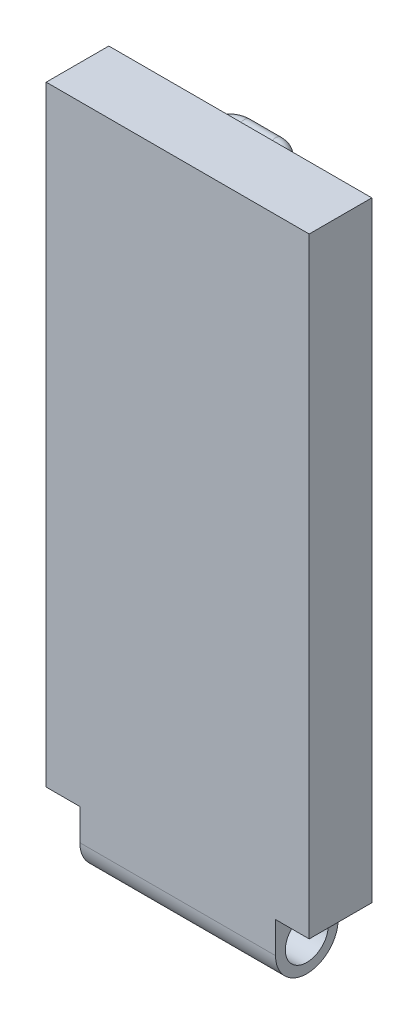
from build123d import *

# Parameters (mm, degrees)
SKETCH_1_W      = 33.6
SKETCH_1_H      = 78
EXTRUDE_1_DEPTH = 8
SKETCH_2_R      = 2.75
EXTRUDE_4_DEPTH = 12.5


with BuildPart() as part:
    # Sketch 1 → Extrude 1 (new body)
    with BuildSketch(Plane.XY):
        with Locations((16.8, 39)):
            Rectangle(SKETCH_1_W, SKETCH_1_H)
    extrude(amount=-EXTRUDE_1_DEPTH)

    # Sketch 2 → Extrude 4 (add, symmetric)
    with BuildSketch(Plane.ZY.offset(-16.8)):
        with BuildLine():
            Line((-8, 0), (0, 0))
            Line((0, 0), (0, -4))
            ThreePointArc((0, -4), (-4, -8), (-8, -4))
            Line((-8, -4), (-8, 0))
        make_face()
        with Locations((-4, -4)):
            Circle(SKETCH_2_R, mode=Mode.SUBTRACT)
    extrude(amount=EXTRUDE_4_DEPTH, both=True)

    # Sweep 1: sweep along a path in Sketch 4
    with BuildLine(Plane(origin=(0, 74, 0), x_dir=(1, 0, 0), z_dir=(0, 1, 0))) as sweep_1_path:
        Line((12.8, 8), (12.8, 8.5))
        ThreePointArc((12.8, 8.5), (13.385786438, 9.914213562), (14.8, 10.5))
        Line((14.8, 10.5), (18.8, 10.5))
        ThreePointArc((18.8, 10.5), (20.214213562, 9.914213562), (20.8, 8.5))
        Line((20.8, 8.5), (20.8, 8))
    # Sketch 3 → Sweep 1 (sweep)
    with BuildSketch(Plane(origin=(0, 0, -8), x_dir=(-1, 0, 0), z_dir=(0, 0, -1))):
        with BuildLine():
            Line((-11.8, 75), (-11.8, 73))
            ThreePointArc((-11.8, 73), (-12.8, 72), (-13.8, 73))
            Line((-13.8, 73), (-13.8, 75))
            ThreePointArc((-13.8, 75), (-12.8, 76), (-11.8, 75))
        make_face()
    sweep(path=sweep_1_path.line)


solid = part.part
